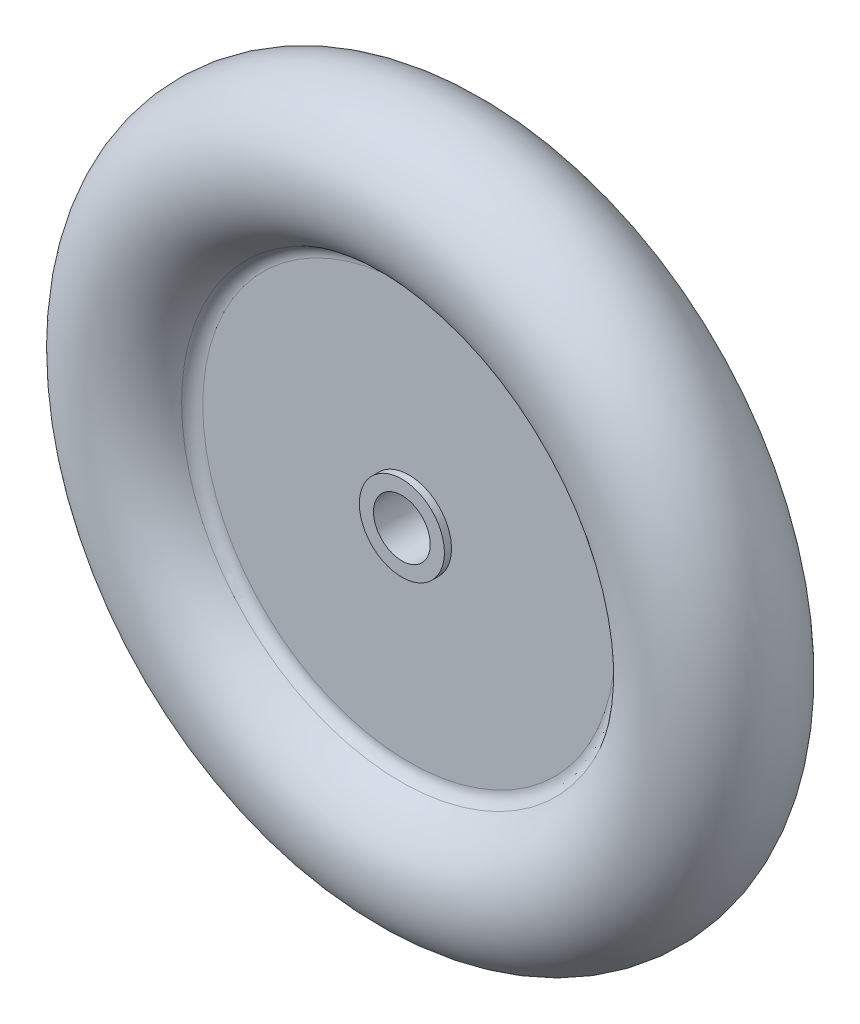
from build123d import *


with BuildPart() as part:
    # Sketch1 → Revolve1 (revolve)
    with BuildSketch(Plane(origin=(0, 0, 0), x_dir=(0, 0, -1), z_dir=(1, 0, 0)), mode=Mode.PRIVATE) as revolve1_sk:
        with BuildLine():
            Line((-1.5, 3), (-2, 3))
            Line((-2, 3), (-2, 2))
            Line((-2, 2), (2, 2))
            Line((2, 2), (2, 3))
            Line((2, 3), (1.5, 3))
            Line((1.5, 3), (1.5, 14.545643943))
            ThreePointArc((1.5, 14.545643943), (1.658374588, 15.085705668), (2.083333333, 15.454703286))
            ThreePointArc((2.083333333, 15.454703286), (0, 25), (-2.083333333, 15.454703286))
            ThreePointArc((-2.083333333, 15.454703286), (-1.658374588, 15.085705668), (-1.5, 14.545643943))
            Line((-1.5, 14.545643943), (-1.5, 3))
        make_face()
    revolve(revolve1_sk.sketch.rotate(Axis((0, 0, -18.162203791), (0, 0, 1)), 90), axis=Axis((0, 0, -18.162203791), (0, 0, 1)))


solid = part.part
